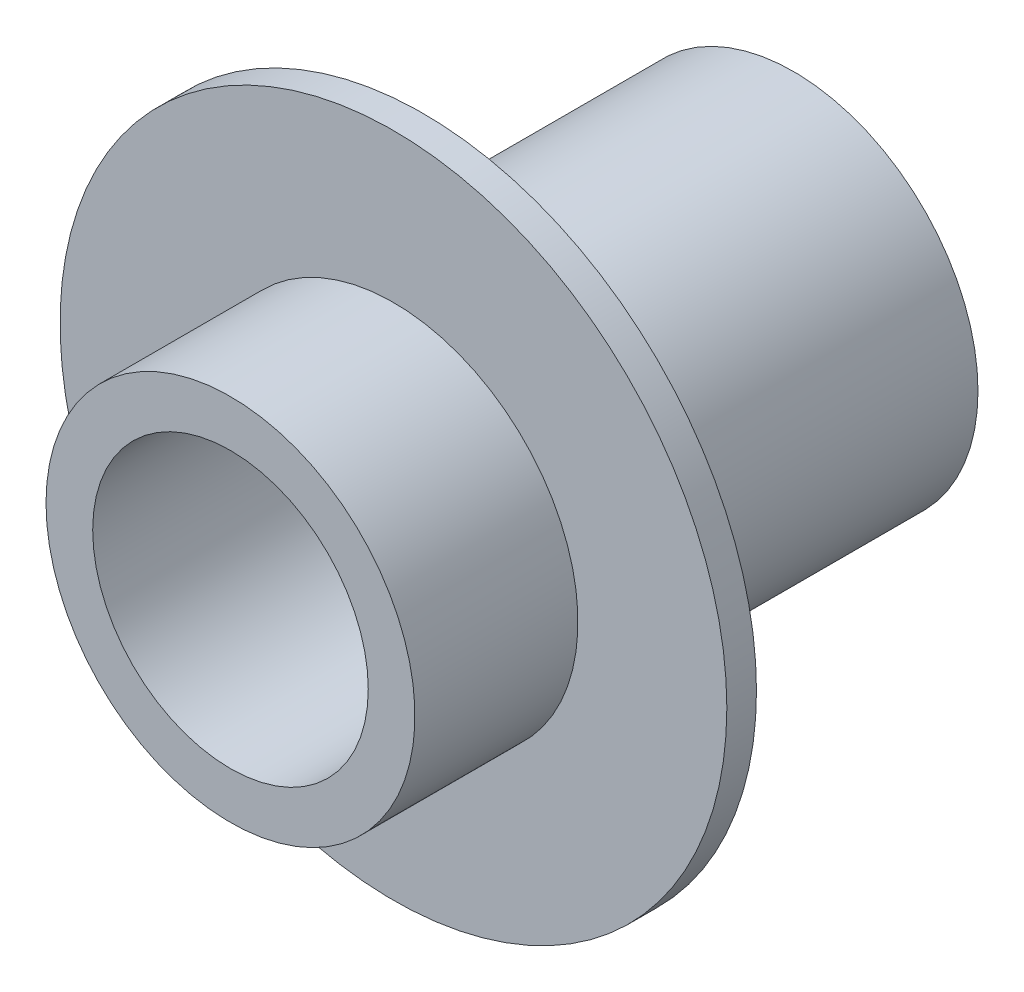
ISO-10303-21;
HEADER;
FILE_DESCRIPTION(('STEP AP214'),'2;1');
FILE_NAME('part.step','',(''),(''),'','','');
FILE_SCHEMA(('AUTOMOTIVE_DESIGN { 1 0 10303 214 1 1 1 1 }'));
ENDSEC;
DATA;
#1=APPLICATION_CONTEXT('core data for automotive mechanical design processes');
#2=APPLICATION_PROTOCOL_DEFINITION('international standard','automotive_design',2000,#1);
#3=PRODUCT_CONTEXT('',#1,'mechanical');
#4=PRODUCT('Part','Part','',(#3));
#5=PRODUCT_RELATED_PRODUCT_CATEGORY('part','',(#4));
#6=PRODUCT_DEFINITION_FORMATION('','',#4);
#7=PRODUCT_DEFINITION_CONTEXT('part definition',#1,'design');
#8=PRODUCT_DEFINITION('design','',#6,#7);
#9=PRODUCT_DEFINITION_SHAPE('','',#8);
#10=(LENGTH_UNIT() NAMED_UNIT(*) SI_UNIT(.MILLI.,.METRE.));
#11=(NAMED_UNIT(*) PLANE_ANGLE_UNIT() SI_UNIT($,.RADIAN.));
#12=(NAMED_UNIT(*) SI_UNIT($,.STERADIAN.) SOLID_ANGLE_UNIT());
#13=UNCERTAINTY_MEASURE_WITH_UNIT(LENGTH_MEASURE(1.E-05),#10,'distance_accuracy_value','');
#14=(GEOMETRIC_REPRESENTATION_CONTEXT(3) GLOBAL_UNCERTAINTY_ASSIGNED_CONTEXT((#13)) GLOBAL_UNIT_ASSIGNED_CONTEXT((#10,
#11,#12)) REPRESENTATION_CONTEXT('',''));
#15=CARTESIAN_POINT('',(0.,0.,0.));
#16=DIRECTION('',(0.,0.,1.));
#17=DIRECTION('',(1.,0.,0.));
#18=AXIS2_PLACEMENT_3D('',#15,#16,#17);
#19=CARTESIAN_POINT('',(0.,0.,0.));
#20=DIRECTION('',(0.,0.,1.));
#21=DIRECTION('',(1.,0.,0.));
#22=AXIS2_PLACEMENT_3D('',#19,#20,#21);
#23=PLANE('',#22);
#24=CARTESIAN_POINT('',(0.,0.,0.));
#25=DIRECTION('',(0.,0.,1.));
#26=DIRECTION('',(1.,0.,0.));
#27=AXIS2_PLACEMENT_3D('',#24,#25,#26);
#28=CIRCLE('',#27,3.1623);
#29=CARTESIAN_POINT('',(3.1623,0.,0.));
#30=VERTEX_POINT('',#29);
#31=EDGE_CURVE('E48',#30,#30,#28,.T.);
#32=ORIENTED_EDGE('',*,*,#31,.F.);
#33=EDGE_LOOP('',(#32));
#34=FACE_BOUND('',#33,.T.);
#35=CARTESIAN_POINT('',(0.,0.,0.));
#36=DIRECTION('',(0.,0.,1.));
#37=DIRECTION('',(1.,0.,0.));
#38=AXIS2_PLACEMENT_3D('',#35,#36,#37);
#39=CIRCLE('',#38,2.3622);
#40=CARTESIAN_POINT('',(2.3622,0.,0.));
#41=VERTEX_POINT('',#40);
#42=EDGE_CURVE('E53',#41,#41,#39,.T.);
#43=ORIENTED_EDGE('',*,*,#42,.T.);
#44=EDGE_LOOP('',(#43));
#45=FACE_BOUND('',#44,.T.);
#46=ADVANCED_FACE('F37',(#34,#45),#23,.F.);
#47=CARTESIAN_POINT('',(0.,0.,6.35));
#48=DIRECTION('',(0.,0.,-1.));
#49=DIRECTION('',(-1.,0.,0.));
#50=AXIS2_PLACEMENT_3D('',#47,#48,#49);
#51=CYLINDRICAL_SURFACE('',#50,3.1623);
#52=CARTESIAN_POINT('',(0.,0.,6.35));
#53=DIRECTION('',(0.,0.,1.));
#54=DIRECTION('',(1.,0.,0.));
#55=AXIS2_PLACEMENT_3D('',#52,#53,#54);
#56=CIRCLE('',#55,3.1623);
#57=CARTESIAN_POINT('',(3.1623,0.,6.35));
#58=VERTEX_POINT('',#57);
#59=EDGE_CURVE('E44',#58,#58,#56,.T.);
#60=ORIENTED_EDGE('',*,*,#59,.F.);
#61=EDGE_LOOP('',(#60));
#62=FACE_BOUND('',#61,.T.);
#63=ORIENTED_EDGE('',*,*,#31,.T.);
#64=EDGE_LOOP('',(#63));
#65=FACE_BOUND('',#64,.T.);
#66=ADVANCED_FACE('F39',(#62,#65),#51,.T.);
#67=CARTESIAN_POINT('',(0.,0.,6.35));
#68=DIRECTION('',(0.,0.,-1.));
#69=DIRECTION('',(-1.,0.,0.));
#70=AXIS2_PLACEMENT_3D('',#67,#68,#69);
#71=CYLINDRICAL_SURFACE('',#70,2.3622);
#72=ORIENTED_EDGE('',*,*,#42,.F.);
#73=EDGE_LOOP('',(#72));
#74=FACE_BOUND('',#73,.T.);
#75=CARTESIAN_POINT('',(0.,0.,9.652));
#76=DIRECTION('',(0.,0.,-1.));
#77=DIRECTION('',(-1.,0.,0.));
#78=AXIS2_PLACEMENT_3D('',#75,#76,#77);
#79=CIRCLE('',#78,2.3622);
#80=CARTESIAN_POINT('',(-2.3622,0.,9.652));
#81=VERTEX_POINT('',#80);
#82=EDGE_CURVE('E66',#81,#81,#79,.T.);
#83=ORIENTED_EDGE('',*,*,#82,.F.);
#84=EDGE_LOOP('',(#83));
#85=FACE_BOUND('',#84,.T.);
#86=ADVANCED_FACE('F73',(#74,#85),#71,.F.);
#87=CARTESIAN_POINT('',(0.,0.,6.35));
#88=DIRECTION('',(0.,0.,1.));
#89=DIRECTION('',(1.,0.,0.));
#90=AXIS2_PLACEMENT_3D('',#87,#88,#89);
#91=PLANE('',#90);
#92=CARTESIAN_POINT('',(0.,0.,6.35));
#93=DIRECTION('',(0.,0.,1.));
#94=DIRECTION('',(1.,0.,0.));
#95=AXIS2_PLACEMENT_3D('',#92,#93,#94);
#96=CIRCLE('',#95,5.715);
#97=CARTESIAN_POINT('',(5.715,0.,6.35));
#98=VERTEX_POINT('',#97);
#99=EDGE_CURVE('E58',#98,#98,#96,.T.);
#100=ORIENTED_EDGE('',*,*,#99,.F.);
#101=EDGE_LOOP('',(#100));
#102=FACE_BOUND('',#101,.T.);
#103=ORIENTED_EDGE('',*,*,#59,.T.);
#104=EDGE_LOOP('',(#103));
#105=FACE_BOUND('',#104,.T.);
#106=ADVANCED_FACE('F75',(#102,#105),#91,.F.);
#107=CARTESIAN_POINT('',(0.,0.,6.858));
#108=DIRECTION('',(0.,0.,1.));
#109=DIRECTION('',(1.,0.,0.));
#110=AXIS2_PLACEMENT_3D('',#107,#108,#109);
#111=PLANE('',#110);
#112=CARTESIAN_POINT('',(0.,0.,6.858));
#113=DIRECTION('',(0.,0.,1.));
#114=DIRECTION('',(1.,0.,0.));
#115=AXIS2_PLACEMENT_3D('',#112,#113,#114);
#116=CIRCLE('',#115,3.1623);
#117=CARTESIAN_POINT('',(-3.1623,0.,6.858));
#118=VERTEX_POINT('',#117);
#119=EDGE_CURVE('E10',#118,#118,#116,.T.);
#120=ORIENTED_EDGE('',*,*,#119,.F.);
#121=EDGE_LOOP('',(#120));
#122=FACE_BOUND('',#121,.T.);
#123=CARTESIAN_POINT('',(0.,0.,6.858));
#124=DIRECTION('',(0.,0.,1.));
#125=DIRECTION('',(1.,0.,0.));
#126=AXIS2_PLACEMENT_3D('',#123,#124,#125);
#127=CIRCLE('',#126,5.715);
#128=CARTESIAN_POINT('',(5.715,0.,6.858));
#129=VERTEX_POINT('',#128);
#130=EDGE_CURVE('E57',#129,#129,#127,.T.);
#131=ORIENTED_EDGE('',*,*,#130,.T.);
#132=EDGE_LOOP('',(#131));
#133=FACE_BOUND('',#132,.T.);
#134=ADVANCED_FACE('F82',(#122,#133),#111,.T.);
#135=CARTESIAN_POINT('',(0.,0.,6.858));
#136=DIRECTION('',(0.,0.,-1.));
#137=DIRECTION('',(-1.,0.,0.));
#138=AXIS2_PLACEMENT_3D('',#135,#136,#137);
#139=CYLINDRICAL_SURFACE('',#138,5.715);
#140=ORIENTED_EDGE('',*,*,#130,.F.);
#141=EDGE_LOOP('',(#140));
#142=FACE_BOUND('',#141,.T.);
#143=ORIENTED_EDGE('',*,*,#99,.T.);
#144=EDGE_LOOP('',(#143));
#145=FACE_BOUND('',#144,.T.);
#146=ADVANCED_FACE('F114',(#142,#145),#139,.T.);
#147=CARTESIAN_POINT('',(0.,0.,9.652));
#148=DIRECTION('',(0.,0.,-1.));
#149=DIRECTION('',(-1.,0.,0.));
#150=AXIS2_PLACEMENT_3D('',#147,#148,#149);
#151=CYLINDRICAL_SURFACE('',#150,3.1623);
#152=CARTESIAN_POINT('',(0.,0.,9.652));
#153=DIRECTION('',(0.,0.,-1.));
#154=DIRECTION('',(-1.,0.,0.));
#155=AXIS2_PLACEMENT_3D('',#152,#153,#154);
#156=CIRCLE('',#155,3.1623);
#157=CARTESIAN_POINT('',(-3.1623,0.,9.652));
#158=VERTEX_POINT('',#157);
#159=EDGE_CURVE('E61',#158,#158,#156,.T.);
#160=CARTESIAN_POINT('',(-3.1623,0.,6.858));
#161=CARTESIAN_POINT('',(-3.1623,0.,6.88710416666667));
#162=CARTESIAN_POINT('',(-3.1623,0.,6.91620833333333));
#163=CARTESIAN_POINT('',(-3.1623,0.,6.97441666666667));
#164=CARTESIAN_POINT('',(-3.1623,0.,7.00352083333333));
#165=CARTESIAN_POINT('',(-3.1623,0.,7.06172916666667));
#166=CARTESIAN_POINT('',(-3.1623,0.,7.09083333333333));
#167=CARTESIAN_POINT('',(-3.1623,0.,7.14904166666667));
#168=CARTESIAN_POINT('',(-3.1623,0.,7.17814583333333));
#169=CARTESIAN_POINT('',(-3.1623,0.,7.23635416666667));
#170=CARTESIAN_POINT('',(-3.1623,0.,7.26545833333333));
#171=CARTESIAN_POINT('',(-3.1623,0.,7.32366666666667));
#172=CARTESIAN_POINT('',(-3.1623,0.,7.35277083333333));
#173=CARTESIAN_POINT('',(-3.1623,0.,7.41097916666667));
#174=CARTESIAN_POINT('',(-3.1623,0.,7.44008333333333));
#175=CARTESIAN_POINT('',(-3.1623,0.,7.49829166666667));
#176=CARTESIAN_POINT('',(-3.1623,0.,7.52739583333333));
#177=CARTESIAN_POINT('',(-3.1623,0.,7.58560416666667));
#178=CARTESIAN_POINT('',(-3.1623,0.,7.61470833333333));
#179=CARTESIAN_POINT('',(-3.1623,0.,7.67291666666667));
#180=CARTESIAN_POINT('',(-3.1623,0.,7.70202083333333));
#181=CARTESIAN_POINT('',(-3.1623,0.,7.76022916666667));
#182=CARTESIAN_POINT('',(-3.1623,0.,7.78933333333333));
#183=CARTESIAN_POINT('',(-3.1623,0.,7.84754166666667));
#184=CARTESIAN_POINT('',(-3.1623,0.,7.87664583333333));
#185=CARTESIAN_POINT('',(-3.1623,0.,7.93485416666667));
#186=CARTESIAN_POINT('',(-3.1623,0.,7.96395833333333));
#187=CARTESIAN_POINT('',(-3.1623,0.,8.02216666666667));
#188=CARTESIAN_POINT('',(-3.1623,0.,8.05127083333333));
#189=CARTESIAN_POINT('',(-3.1623,0.,8.10947916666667));
#190=CARTESIAN_POINT('',(-3.1623,0.,8.13858333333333));
#191=CARTESIAN_POINT('',(-3.1623,0.,8.19679166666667));
#192=CARTESIAN_POINT('',(-3.1623,0.,8.22589583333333));
#193=CARTESIAN_POINT('',(-3.1623,0.,8.28410416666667));
#194=CARTESIAN_POINT('',(-3.1623,0.,8.31320833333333));
#195=CARTESIAN_POINT('',(-3.1623,0.,8.37141666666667));
#196=CARTESIAN_POINT('',(-3.1623,0.,8.40052083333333));
#197=CARTESIAN_POINT('',(-3.1623,0.,8.45872916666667));
#198=CARTESIAN_POINT('',(-3.1623,0.,8.48783333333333));
#199=CARTESIAN_POINT('',(-3.1623,0.,8.54604166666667));
#200=CARTESIAN_POINT('',(-3.1623,0.,8.57514583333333));
#201=CARTESIAN_POINT('',(-3.1623,0.,8.63335416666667));
#202=CARTESIAN_POINT('',(-3.1623,0.,8.66245833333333));
#203=CARTESIAN_POINT('',(-3.1623,0.,8.72066666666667));
#204=CARTESIAN_POINT('',(-3.1623,0.,8.74977083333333));
#205=CARTESIAN_POINT('',(-3.1623,0.,8.80797916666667));
#206=CARTESIAN_POINT('',(-3.1623,0.,8.83708333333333));
#207=CARTESIAN_POINT('',(-3.1623,0.,8.89529166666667));
#208=CARTESIAN_POINT('',(-3.1623,0.,8.92439583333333));
#209=CARTESIAN_POINT('',(-3.1623,0.,8.98260416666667));
#210=CARTESIAN_POINT('',(-3.1623,0.,9.01170833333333));
#211=CARTESIAN_POINT('',(-3.1623,0.,9.06991666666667));
#212=CARTESIAN_POINT('',(-3.1623,0.,9.09902083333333));
#213=CARTESIAN_POINT('',(-3.1623,0.,9.15722916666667));
#214=CARTESIAN_POINT('',(-3.1623,0.,9.18633333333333));
#215=CARTESIAN_POINT('',(-3.1623,0.,9.24454166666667));
#216=CARTESIAN_POINT('',(-3.1623,0.,9.27364583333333));
#217=CARTESIAN_POINT('',(-3.1623,0.,9.33185416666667));
#218=CARTESIAN_POINT('',(-3.1623,0.,9.36095833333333));
#219=CARTESIAN_POINT('',(-3.1623,0.,9.41916666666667));
#220=CARTESIAN_POINT('',(-3.1623,0.,9.44827083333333));
#221=CARTESIAN_POINT('',(-3.1623,0.,9.50647916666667));
#222=CARTESIAN_POINT('',(-3.1623,0.,9.53558333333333));
#223=CARTESIAN_POINT('',(-3.1623,0.,9.59379166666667));
#224=CARTESIAN_POINT('',(-3.1623,0.,9.62289583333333));
#225=CARTESIAN_POINT('',(-3.1623,0.,9.652));
#226=B_SPLINE_CURVE_WITH_KNOTS('',3,(#160,#161,#162,#163,#164,#165,#166,#167,#168,#169,#170,
#171,#172,#173,#174,#175,#176,#177,#178,#179,#180,#181,#182,#183,#184,#185,#186,#187,#188,#189,
#190,#191,#192,#193,#194,#195,#196,#197,#198,#199,#200,#201,#202,#203,#204,#205,#206,#207,#208,
#209,#210,#211,#212,#213,#214,#215,#216,#217,#218,#219,#220,#221,#222,#223,#224,#225),
.UNSPECIFIED.,.F.,.F.,(4,2,2,2,2,2,2,2,2,2,2,2,2,2,2,2,2,2,2,2,2,2,2,2,2,2,2,2,2,2,2,2,4),(0.,
0.0873124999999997,0.174624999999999,0.2619375,0.34925,0.436562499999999,0.523875,0.6111875,
0.698499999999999,0.7858125,0.873125,0.960437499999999,1.04775,1.1350625,1.222375,1.3096875,
1.397,1.4843125,1.571625,1.6589375,1.74625,1.8335625,1.920875,2.0081875,2.0955,2.1828125,
2.270125,2.3574375,2.44475,2.5320625,2.619375,2.7066875,2.794),.UNSPECIFIED.);
#227=EDGE_CURVE('BSEAM118',#118,#158,#226,.T.);
#228=ORIENTED_EDGE('',*,*,#119,.T.);
#229=ORIENTED_EDGE('',*,*,#159,.T.);
#230=ORIENTED_EDGE('',*,*,#227,.T.);
#231=ORIENTED_EDGE('',*,*,#227,.F.);
#232=EDGE_LOOP('',(#228,#230,#229,#231));
#233=FACE_BOUND('',#232,.T.);
#234=ADVANCED_FACE('F118',(#233),#151,.T.);
#235=CARTESIAN_POINT('',(0.,0.,9.652));
#236=DIRECTION('',(0.,0.,-1.));
#237=DIRECTION('',(-1.,0.,0.));
#238=AXIS2_PLACEMENT_3D('',#235,#236,#237);
#239=PLANE('',#238);
#240=ORIENTED_EDGE('',*,*,#82,.T.);
#241=EDGE_LOOP('',(#240));
#242=FACE_BOUND('',#241,.T.);
#243=ORIENTED_EDGE('',*,*,#159,.F.);
#244=EDGE_LOOP('',(#243));
#245=FACE_BOUND('',#244,.T.);
#246=ADVANCED_FACE('F70',(#242,#245),#239,.F.);
#247=CLOSED_SHELL('',(#46,#66,#86,#106,#134,#146,#234,#246));
#248=MANIFOLD_SOLID_BREP('B2',#247);
#249=ADVANCED_BREP_SHAPE_REPRESENTATION('',(#18,#248),#14);
#250=SHAPE_DEFINITION_REPRESENTATION(#9,#249);
ENDSEC;
END-ISO-10303-21;
